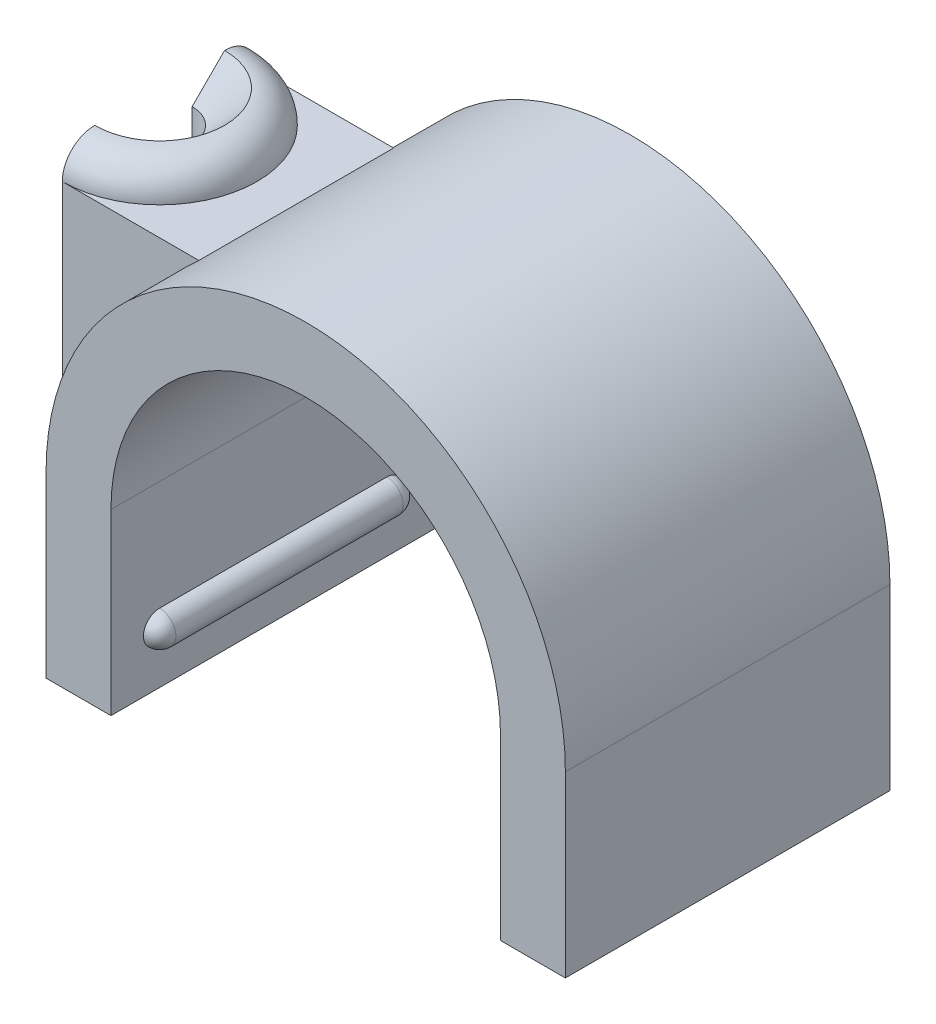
ISO-10303-21;
HEADER;
FILE_DESCRIPTION(('STEP AP214'),'2;1');
FILE_NAME('part.step','',(''),(''),'','','');
FILE_SCHEMA(('AUTOMOTIVE_DESIGN { 1 0 10303 214 1 1 1 1 }'));
ENDSEC;
DATA;
#1=APPLICATION_CONTEXT('core data for automotive mechanical design processes');
#2=APPLICATION_PROTOCOL_DEFINITION('international standard','automotive_design',2000,#1);
#3=PRODUCT_CONTEXT('',#1,'mechanical');
#4=PRODUCT('Part','Part','',(#3));
#5=PRODUCT_RELATED_PRODUCT_CATEGORY('part','',(#4));
#6=PRODUCT_DEFINITION_FORMATION('','',#4);
#7=PRODUCT_DEFINITION_CONTEXT('part definition',#1,'design');
#8=PRODUCT_DEFINITION('design','',#6,#7);
#9=PRODUCT_DEFINITION_SHAPE('','',#8);
#10=(LENGTH_UNIT() NAMED_UNIT(*) SI_UNIT(.MILLI.,.METRE.));
#11=(NAMED_UNIT(*) PLANE_ANGLE_UNIT() SI_UNIT($,.RADIAN.));
#12=(NAMED_UNIT(*) SI_UNIT($,.STERADIAN.) SOLID_ANGLE_UNIT());
#13=UNCERTAINTY_MEASURE_WITH_UNIT(LENGTH_MEASURE(1.E-05),#10,'distance_accuracy_value','');
#14=(GEOMETRIC_REPRESENTATION_CONTEXT(3) GLOBAL_UNCERTAINTY_ASSIGNED_CONTEXT((#13)) GLOBAL_UNIT_ASSIGNED_CONTEXT((#10,
#11,#12)) REPRESENTATION_CONTEXT('',''));
#15=CARTESIAN_POINT('',(0.,0.,0.));
#16=DIRECTION('',(0.,0.,1.));
#17=DIRECTION('',(1.,0.,0.));
#18=AXIS2_PLACEMENT_3D('',#15,#16,#17);
#19=CARTESIAN_POINT('',(0.,0.,-10.));
#20=DIRECTION('',(0.,-1.,0.));
#21=DIRECTION('',(0.,0.,-1.));
#22=AXIS2_PLACEMENT_3D('',#19,#20,#21);
#23=PLANE('',#22);
#24=DIRECTION('',(-1.,0.,0.));
#25=VECTOR('',#24,1.);
#26=CARTESIAN_POINT('',(16.001,0.,-2.));
#27=LINE('',#26,#25);
#28=CARTESIAN_POINT('',(0.,0.,-2.));
#29=VERTEX_POINT('',#28);
#30=CARTESIAN_POINT('',(-1.5,0.,-2.));
#31=VERTEX_POINT('',#30);
#32=EDGE_CURVE('E188',#29,#31,#27,.T.);
#33=ORIENTED_EDGE('',*,*,#32,.T.);
#34=DIRECTION('',(0.,0.,-1.));
#35=VECTOR('',#34,1.);
#36=CARTESIAN_POINT('',(-1.5,0.,1.26994984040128));
#37=LINE('',#36,#35);
#38=CARTESIAN_POINT('',(-1.5,1.1369377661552E-11,-4.));
#39=VERTEX_POINT('',#38);
#40=EDGE_CURVE('E184',#31,#39,#37,.T.);
#41=ORIENTED_EDGE('',*,*,#40,.T.);
#42=CARTESIAN_POINT('',(-1.5,1.1369377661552E-11,-5.));
#43=DIRECTION('',(0.,1.,0.));
#44=DIRECTION('',(0.,0.,1.));
#45=AXIS2_PLACEMENT_3D('',#42,#43,#44);
#46=CIRCLE('',#45,0.999999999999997);
#47=CARTESIAN_POINT('',(-1.5,1.1369377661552E-11,-6.));
#48=VERTEX_POINT('',#47);
#49=EDGE_CURVE('E370',#39,#48,#46,.T.);
#50=ORIENTED_EDGE('',*,*,#49,.T.);
#51=CARTESIAN_POINT('',(-1.5,0.,-8.));
#52=VERTEX_POINT('',#51);
#53=EDGE_CURVE('E56',#48,#52,#37,.T.);
#54=ORIENTED_EDGE('',*,*,#53,.T.);
#55=DIRECTION('',(-1.,0.,0.));
#56=VECTOR('',#55,1.);
#57=CARTESIAN_POINT('',(16.001,0.,-8.));
#58=LINE('',#57,#56);
#59=CARTESIAN_POINT('',(0.,0.,-8.));
#60=VERTEX_POINT('',#59);
#61=EDGE_CURVE('E220',#60,#52,#58,.T.);
#62=ORIENTED_EDGE('',*,*,#61,.F.);
#63=DIRECTION('',(0.,0.,1.));
#64=VECTOR('',#63,1.);
#65=CARTESIAN_POINT('',(0.,0.,-10.));
#66=LINE('',#65,#64);
#67=CARTESIAN_POINT('',(0.,0.,-10.));
#68=VERTEX_POINT('',#67);
#69=EDGE_CURVE('E273',#68,#60,#66,.T.);
#70=ORIENTED_EDGE('',*,*,#69,.F.);
#71=DIRECTION('',(1.,0.,0.));
#72=VECTOR('',#71,1.);
#73=CARTESIAN_POINT('',(0.,0.,-10.));
#74=LINE('',#73,#72);
#75=CARTESIAN_POINT('',(2.,0.,-10.));
#76=VERTEX_POINT('',#75);
#77=EDGE_CURVE('E248',#68,#76,#74,.T.);
#78=ORIENTED_EDGE('',*,*,#77,.T.);
#79=DIRECTION('',(0.,0.,1.));
#80=VECTOR('',#79,1.);
#81=CARTESIAN_POINT('',(2.,0.,-10.));
#82=LINE('',#81,#80);
#83=CARTESIAN_POINT('',(2.,0.,0.));
#84=VERTEX_POINT('',#83);
#85=EDGE_CURVE('E272',#76,#84,#82,.T.);
#86=ORIENTED_EDGE('',*,*,#85,.T.);
#87=DIRECTION('',(1.,0.,0.));
#88=VECTOR('',#87,1.);
#89=CARTESIAN_POINT('',(0.,0.,0.));
#90=LINE('',#89,#88);
#91=CARTESIAN_POINT('',(0.,0.,0.));
#92=VERTEX_POINT('',#91);
#93=EDGE_CURVE('E209',#92,#84,#90,.T.);
#94=ORIENTED_EDGE('',*,*,#93,.F.);
#95=EDGE_CURVE('E277',#29,#92,#66,.T.);
#96=ORIENTED_EDGE('',*,*,#95,.F.);
#97=EDGE_LOOP('',(#33,#41,#50,#54,#62,#70,#78,#86,#94,#96));
#98=FACE_BOUND('',#97,.T.);
#99=ADVANCED_FACE('F34',(#98),#23,.T.);
#100=CARTESIAN_POINT('',(-1.5,11.5,-5.));
#101=DIRECTION('',(0.,-1.,0.));
#102=DIRECTION('',(0.,0.,-1.));
#103=AXIS2_PLACEMENT_3D('',#100,#101,#102);
#104=TOROIDAL_SURFACE('',#103,2.,1.);
#105=CARTESIAN_POINT('',(-1.5,12.5,-5.));
#106=DIRECTION('',(0.,1.,0.));
#107=DIRECTION('',(0.,0.,1.));
#108=AXIS2_PLACEMENT_3D('',#105,#106,#107);
#109=CIRCLE('',#108,2.);
#110=CARTESIAN_POINT('',(-1.5,12.5,-3.));
#111=VERTEX_POINT('',#110);
#112=CARTESIAN_POINT('',(-1.5,12.5,-7.));
#113=VERTEX_POINT('',#112);
#114=EDGE_CURVE('E199',#111,#113,#109,.T.);
#115=ORIENTED_EDGE('',*,*,#114,.F.);
#116=CARTESIAN_POINT('',(-1.5,11.5,-3.));
#117=DIRECTION('',(-1.,0.,0.));
#118=DIRECTION('',(0.,0.,1.));
#119=AXIS2_PLACEMENT_3D('',#116,#117,#118);
#120=CIRCLE('',#119,1.);
#121=CARTESIAN_POINT('',(-1.5,11.5,-2.));
#122=VERTEX_POINT('',#121);
#123=EDGE_CURVE('E182',#122,#111,#120,.T.);
#124=ORIENTED_EDGE('',*,*,#123,.F.);
#125=CARTESIAN_POINT('',(-1.5,11.5,-5.));
#126=DIRECTION('',(0.,-1.,0.));
#127=DIRECTION('',(0.,0.,-1.));
#128=AXIS2_PLACEMENT_3D('',#125,#126,#127);
#129=CIRCLE('',#128,3.);
#130=CARTESIAN_POINT('',(-1.5,11.5,-8.));
#131=VERTEX_POINT('',#130);
#132=EDGE_CURVE('E197',#131,#122,#129,.T.);
#133=ORIENTED_EDGE('',*,*,#132,.F.);
#134=CARTESIAN_POINT('',(-1.5,11.5,-7.));
#135=DIRECTION('',(-1.,0.,0.));
#136=DIRECTION('',(0.,0.,1.));
#137=AXIS2_PLACEMENT_3D('',#134,#135,#136);
#138=CIRCLE('',#137,1.);
#139=EDGE_CURVE('E382',#113,#131,#138,.T.);
#140=ORIENTED_EDGE('',*,*,#139,.F.);
#141=EDGE_LOOP('',(#115,#124,#133,#140));
#142=FACE_BOUND('',#141,.T.);
#143=ADVANCED_FACE('F195',(#142),#104,.T.);
#144=CARTESIAN_POINT('',(-1.5,12.5,-5.));
#145=DIRECTION('',(0.,1.,0.));
#146=DIRECTION('',(0.,0.,1.));
#147=AXIS2_PLACEMENT_3D('',#144,#145,#146);
#148=CONICAL_SURFACE('',#147,2.,0.785398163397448);
#149=DIRECTION('',(0.,0.707106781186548,0.707106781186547));
#150=VECTOR('',#149,1.);
#151=CARTESIAN_POINT('',(-1.5,10.5,-5.));
#152=LINE('',#151,#150);
#153=CARTESIAN_POINT('',(-1.5,11.5,-4.));
#154=VERTEX_POINT('',#153);
#155=EDGE_CURVE('E48',#154,#111,#152,.T.);
#156=ORIENTED_EDGE('',*,*,#155,.T.);
#157=ORIENTED_EDGE('',*,*,#114,.T.);
#158=DIRECTION('',(0.,-0.707106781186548,0.707106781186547));
#159=VECTOR('',#158,1.);
#160=CARTESIAN_POINT('',(-1.5,10.5,-5.));
#161=LINE('',#160,#159);
#162=CARTESIAN_POINT('',(-1.5,11.5,-6.));
#163=VERTEX_POINT('',#162);
#164=EDGE_CURVE('E384',#113,#163,#161,.T.);
#165=ORIENTED_EDGE('',*,*,#164,.T.);
#166=CARTESIAN_POINT('',(-1.5,11.5,-5.));
#167=DIRECTION('',(0.,1.,0.));
#168=DIRECTION('',(0.,0.,1.));
#169=AXIS2_PLACEMENT_3D('',#166,#167,#168);
#170=CIRCLE('',#169,0.999999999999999);
#171=EDGE_CURVE('E367',#154,#163,#170,.T.);
#172=ORIENTED_EDGE('',*,*,#171,.F.);
#173=EDGE_LOOP('',(#156,#157,#165,#172));
#174=FACE_BOUND('',#173,.T.);
#175=ADVANCED_FACE('F349',(#174),#148,.F.);
#176=CARTESIAN_POINT('',(-1.5,12.5,-5.));
#177=DIRECTION('',(0.,1.,0.));
#178=DIRECTION('',(0.,0.,1.));
#179=AXIS2_PLACEMENT_3D('',#176,#177,#178);
#180=CYLINDRICAL_SURFACE('',#179,0.999999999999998);
#181=DIRECTION('',(0.,1.,0.));
#182=VECTOR('',#181,1.);
#183=CARTESIAN_POINT('',(-1.5,12.5,-4.));
#184=LINE('',#183,#182);
#185=EDGE_CURVE('E380',#39,#154,#184,.T.);
#186=ORIENTED_EDGE('',*,*,#185,.T.);
#187=ORIENTED_EDGE('',*,*,#171,.T.);
#188=DIRECTION('',(0.,1.,0.));
#189=VECTOR('',#188,1.);
#190=CARTESIAN_POINT('',(-1.5,12.5,-6.));
#191=LINE('',#190,#189);
#192=EDGE_CURVE('E387',#163,#48,#191,.F.);
#193=ORIENTED_EDGE('',*,*,#192,.T.);
#194=ORIENTED_EDGE('',*,*,#49,.F.);
#195=EDGE_LOOP('',(#186,#187,#193,#194));
#196=FACE_BOUND('',#195,.T.);
#197=ADVANCED_FACE('F444',(#196),#180,.F.);
#198=CARTESIAN_POINT('',(0.,0.,-10.));
#199=DIRECTION('',(-1.,0.,0.));
#200=DIRECTION('',(0.,0.,1.));
#201=AXIS2_PLACEMENT_3D('',#198,#199,#200);
#202=PLANE('',#201);
#203=ORIENTED_EDGE('',*,*,#69,.T.);
#204=DIRECTION('',(0.,-1.,0.));
#205=VECTOR('',#204,1.);
#206=CARTESIAN_POINT('',(0.,0.,-8.));
#207=LINE('',#206,#205);
#208=CARTESIAN_POINT('',(0.,5.5,-8.));
#209=VERTEX_POINT('',#208);
#210=EDGE_CURVE('E224',#209,#60,#207,.T.);
#211=ORIENTED_EDGE('',*,*,#210,.F.);
#212=DIRECTION('',(0.,0.,1.));
#213=VECTOR('',#212,1.);
#214=CARTESIAN_POINT('',(0.,5.5,-10.));
#215=LINE('',#214,#213);
#216=CARTESIAN_POINT('',(0.,5.5,-10.));
#217=VERTEX_POINT('',#216);
#218=EDGE_CURVE('E278',#217,#209,#215,.T.);
#219=ORIENTED_EDGE('',*,*,#218,.F.);
#220=DIRECTION('',(0.,-1.,0.));
#221=VECTOR('',#220,1.);
#222=CARTESIAN_POINT('',(0.,0.,-10.));
#223=LINE('',#222,#221);
#224=EDGE_CURVE('E269',#217,#68,#223,.T.);
#225=ORIENTED_EDGE('',*,*,#224,.T.);
#226=EDGE_LOOP('',(#203,#211,#219,#225));
#227=FACE_BOUND('',#226,.T.);
#228=ADVANCED_FACE('F394',(#227),#202,.T.);
#229=CARTESIAN_POINT('',(0.,5.5,-2.));
#230=VERTEX_POINT('',#229);
#231=CARTESIAN_POINT('',(0.,5.5,0.));
#232=VERTEX_POINT('',#231);
#233=EDGE_CURVE('E281',#230,#232,#215,.T.);
#234=ORIENTED_EDGE('',*,*,#233,.F.);
#235=DIRECTION('',(0.,1.,0.));
#236=VECTOR('',#235,1.);
#237=CARTESIAN_POINT('',(0.,0.,-2.));
#238=LINE('',#237,#236);
#239=EDGE_CURVE('E215',#29,#230,#238,.T.);
#240=ORIENTED_EDGE('',*,*,#239,.F.);
#241=ORIENTED_EDGE('',*,*,#95,.T.);
#242=DIRECTION('',(0.,-1.,0.));
#243=VECTOR('',#242,1.);
#244=CARTESIAN_POINT('',(0.,0.,0.));
#245=LINE('',#244,#243);
#246=EDGE_CURVE('E245',#232,#92,#245,.T.);
#247=ORIENTED_EDGE('',*,*,#246,.F.);
#248=EDGE_LOOP('',(#234,#240,#241,#247));
#249=FACE_BOUND('',#248,.T.);
#250=ADVANCED_FACE('F415',(#249),#202,.T.);
#251=CARTESIAN_POINT('',(8.,5.5,-10.));
#252=DIRECTION('',(0.,0.,1.));
#253=DIRECTION('',(1.,0.,0.));
#254=AXIS2_PLACEMENT_3D('',#251,#252,#253);
#255=CYLINDRICAL_SURFACE('',#254,8.);
#256=ORIENTED_EDGE('',*,*,#218,.T.);
#257=CARTESIAN_POINT('',(8.,5.5,-8.));
#258=DIRECTION('',(0.,0.,1.));
#259=DIRECTION('',(1.,0.,0.));
#260=AXIS2_PLACEMENT_3D('',#257,#258,#259);
#261=CIRCLE('',#260,8.);
#262=CARTESIAN_POINT('',(2.70849737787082,11.5,-8.));
#263=VERTEX_POINT('',#262);
#264=EDGE_CURVE('E360',#263,#209,#261,.T.);
#265=ORIENTED_EDGE('',*,*,#264,.F.);
#266=DIRECTION('',(0.,0.,1.));
#267=VECTOR('',#266,1.);
#268=CARTESIAN_POINT('',(2.70849737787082,11.5,-10.));
#269=LINE('',#268,#267);
#270=CARTESIAN_POINT('',(2.70849737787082,11.5,-2.));
#271=VERTEX_POINT('',#270);
#272=EDGE_CURVE('E356',#271,#263,#269,.F.);
#273=ORIENTED_EDGE('',*,*,#272,.F.);
#274=CARTESIAN_POINT('',(8.,5.5,-2.));
#275=DIRECTION('',(0.,0.,-1.));
#276=DIRECTION('',(0.,1.,0.));
#277=AXIS2_PLACEMENT_3D('',#274,#275,#276);
#278=CIRCLE('',#277,8.);
#279=EDGE_CURVE('E213',#230,#271,#278,.T.);
#280=ORIENTED_EDGE('',*,*,#279,.F.);
#281=ORIENTED_EDGE('',*,*,#233,.T.);
#282=CARTESIAN_POINT('',(8.,5.5,0.));
#283=DIRECTION('',(0.,0.,1.));
#284=DIRECTION('',(-1.,0.,0.));
#285=AXIS2_PLACEMENT_3D('',#282,#283,#284);
#286=CIRCLE('',#285,8.);
#287=CARTESIAN_POINT('',(16.,5.5,0.));
#288=VERTEX_POINT('',#287);
#289=EDGE_CURVE('E242',#288,#232,#286,.T.);
#290=ORIENTED_EDGE('',*,*,#289,.F.);
#291=DIRECTION('',(0.,0.,1.));
#292=VECTOR('',#291,1.);
#293=CARTESIAN_POINT('',(16.,5.5,-10.));
#294=LINE('',#293,#292);
#295=CARTESIAN_POINT('',(16.,5.5,-10.));
#296=VERTEX_POINT('',#295);
#297=EDGE_CURVE('E282',#296,#288,#294,.T.);
#298=ORIENTED_EDGE('',*,*,#297,.F.);
#299=CARTESIAN_POINT('',(8.,5.5,-10.));
#300=DIRECTION('',(0.,0.,1.));
#301=DIRECTION('',(-1.,0.,0.));
#302=AXIS2_PLACEMENT_3D('',#299,#300,#301);
#303=CIRCLE('',#302,8.);
#304=EDGE_CURVE('E266',#296,#217,#303,.T.);
#305=ORIENTED_EDGE('',*,*,#304,.T.);
#306=EDGE_LOOP('',(#256,#265,#273,#280,#281,#290,#298,#305));
#307=FACE_BOUND('',#306,.T.);
#308=ADVANCED_FACE('F396',(#307),#255,.T.);
#309=CARTESIAN_POINT('',(16.,0.,-10.));
#310=DIRECTION('',(1.,0.,0.));
#311=DIRECTION('',(0.,0.,-1.));
#312=AXIS2_PLACEMENT_3D('',#309,#310,#311);
#313=PLANE('',#312);
#314=DIRECTION('',(0.,1.,0.));
#315=VECTOR('',#314,1.);
#316=CARTESIAN_POINT('',(16.,0.,0.));
#317=LINE('',#316,#315);
#318=CARTESIAN_POINT('',(16.,0.,0.));
#319=VERTEX_POINT('',#318);
#320=EDGE_CURVE('E239',#319,#288,#317,.T.);
#321=ORIENTED_EDGE('',*,*,#320,.F.);
#322=DIRECTION('',(0.,0.,1.));
#323=VECTOR('',#322,1.);
#324=CARTESIAN_POINT('',(16.,0.,-10.));
#325=LINE('',#324,#323);
#326=CARTESIAN_POINT('',(16.,0.,-10.));
#327=VERTEX_POINT('',#326);
#328=EDGE_CURVE('E284',#327,#319,#325,.T.);
#329=ORIENTED_EDGE('',*,*,#328,.F.);
#330=DIRECTION('',(0.,1.,0.));
#331=VECTOR('',#330,1.);
#332=CARTESIAN_POINT('',(16.,0.,-10.));
#333=LINE('',#332,#331);
#334=EDGE_CURVE('E263',#327,#296,#333,.T.);
#335=ORIENTED_EDGE('',*,*,#334,.T.);
#336=ORIENTED_EDGE('',*,*,#297,.T.);
#337=EDGE_LOOP('',(#321,#329,#335,#336));
#338=FACE_BOUND('',#337,.T.);
#339=ADVANCED_FACE('F419',(#338),#313,.T.);
#340=CARTESIAN_POINT('',(14.,0.,-10.));
#341=DIRECTION('',(0.,-1.,0.));
#342=DIRECTION('',(0.,0.,-1.));
#343=AXIS2_PLACEMENT_3D('',#340,#341,#342);
#344=PLANE('',#343);
#345=DIRECTION('',(1.,0.,0.));
#346=VECTOR('',#345,1.);
#347=CARTESIAN_POINT('',(14.,0.,0.));
#348=LINE('',#347,#346);
#349=CARTESIAN_POINT('',(14.,0.,0.));
#350=VERTEX_POINT('',#349);
#351=EDGE_CURVE('E236',#350,#319,#348,.T.);
#352=ORIENTED_EDGE('',*,*,#351,.F.);
#353=DIRECTION('',(0.,0.,1.));
#354=VECTOR('',#353,1.);
#355=CARTESIAN_POINT('',(14.,0.,-10.));
#356=LINE('',#355,#354);
#357=CARTESIAN_POINT('',(14.,0.,-10.));
#358=VERTEX_POINT('',#357);
#359=EDGE_CURVE('E286',#358,#350,#356,.T.);
#360=ORIENTED_EDGE('',*,*,#359,.F.);
#361=DIRECTION('',(1.,0.,0.));
#362=VECTOR('',#361,1.);
#363=CARTESIAN_POINT('',(14.,0.,-10.));
#364=LINE('',#363,#362);
#365=EDGE_CURVE('E260',#358,#327,#364,.T.);
#366=ORIENTED_EDGE('',*,*,#365,.T.);
#367=ORIENTED_EDGE('',*,*,#328,.T.);
#368=EDGE_LOOP('',(#352,#360,#366,#367));
#369=FACE_BOUND('',#368,.T.);
#370=ADVANCED_FACE('F423',(#369),#344,.T.);
#371=CARTESIAN_POINT('',(14.,0.,-10.));
#372=DIRECTION('',(-1.,0.,0.));
#373=DIRECTION('',(0.,0.,1.));
#374=AXIS2_PLACEMENT_3D('',#371,#372,#373);
#375=PLANE('',#374);
#376=CARTESIAN_POINT('',(14.,1.61906828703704,-1.5));
#377=DIRECTION('',(-1.,0.,0.));
#378=DIRECTION('',(0.,0.,1.));
#379=AXIS2_PLACEMENT_3D('',#376,#377,#378);
#380=CIRCLE('',#379,0.5);
#381=CARTESIAN_POINT('',(14.,2.11906828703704,-1.5));
#382=VERTEX_POINT('',#381);
#383=CARTESIAN_POINT('',(14.,1.61906828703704,-1.));
#384=VERTEX_POINT('',#383);
#385=EDGE_CURVE('E312',#382,#384,#380,.F.);
#386=ORIENTED_EDGE('',*,*,#385,.T.);
#387=CARTESIAN_POINT('',(14.,1.61906828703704,-1.5));
#388=DIRECTION('',(-1.,0.,0.));
#389=DIRECTION('',(0.,0.,1.));
#390=AXIS2_PLACEMENT_3D('',#387,#388,#389);
#391=CIRCLE('',#390,0.5);
#392=CARTESIAN_POINT('',(14.,1.11906828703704,-1.5));
#393=VERTEX_POINT('',#392);
#394=EDGE_CURVE('E314',#384,#393,#391,.F.);
#395=ORIENTED_EDGE('',*,*,#394,.T.);
#396=DIRECTION('',(0.,0.,-1.));
#397=VECTOR('',#396,1.);
#398=CARTESIAN_POINT('',(14.,1.11906828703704,-1.));
#399=LINE('',#398,#397);
#400=CARTESIAN_POINT('',(14.,1.11906828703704,-8.5));
#401=VERTEX_POINT('',#400);
#402=EDGE_CURVE('E328',#393,#401,#399,.T.);
#403=ORIENTED_EDGE('',*,*,#402,.T.);
#404=CARTESIAN_POINT('',(14.,1.61906828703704,-8.5));
#405=DIRECTION('',(-1.,0.,0.));
#406=DIRECTION('',(0.,0.,1.));
#407=AXIS2_PLACEMENT_3D('',#404,#405,#406);
#408=CIRCLE('',#407,0.5);
#409=CARTESIAN_POINT('',(14.,1.61906828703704,-9.));
#410=VERTEX_POINT('',#409);
#411=EDGE_CURVE('E13',#401,#410,#408,.F.);
#412=ORIENTED_EDGE('',*,*,#411,.T.);
#413=CARTESIAN_POINT('',(14.,1.61906828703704,-8.5));
#414=DIRECTION('',(-1.,0.,0.));
#415=DIRECTION('',(0.,0.,1.));
#416=AXIS2_PLACEMENT_3D('',#413,#414,#415);
#417=CIRCLE('',#416,0.5);
#418=CARTESIAN_POINT('',(14.,2.11906828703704,-8.5));
#419=VERTEX_POINT('',#418);
#420=EDGE_CURVE('E41',#410,#419,#417,.F.);
#421=ORIENTED_EDGE('',*,*,#420,.T.);
#422=DIRECTION('',(0.,0.,-1.));
#423=VECTOR('',#422,1.);
#424=CARTESIAN_POINT('',(14.,2.11906828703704,-1.));
#425=LINE('',#424,#423);
#426=EDGE_CURVE('E200',#382,#419,#425,.T.);
#427=ORIENTED_EDGE('',*,*,#426,.F.);
#428=EDGE_LOOP('',(#386,#395,#403,#412,#421,#427));
#429=FACE_BOUND('',#428,.T.);
#430=DIRECTION('',(0.,-1.,0.));
#431=VECTOR('',#430,1.);
#432=CARTESIAN_POINT('',(14.,0.,0.));
#433=LINE('',#432,#431);
#434=CARTESIAN_POINT('',(14.,5.5,0.));
#435=VERTEX_POINT('',#434);
#436=EDGE_CURVE('E233',#435,#350,#433,.T.);
#437=ORIENTED_EDGE('',*,*,#436,.F.);
#438=DIRECTION('',(0.,0.,1.));
#439=VECTOR('',#438,1.);
#440=CARTESIAN_POINT('',(14.,5.5,-10.));
#441=LINE('',#440,#439);
#442=CARTESIAN_POINT('',(14.,5.5,-10.));
#443=VERTEX_POINT('',#442);
#444=EDGE_CURVE('E288',#443,#435,#441,.T.);
#445=ORIENTED_EDGE('',*,*,#444,.F.);
#446=DIRECTION('',(0.,-1.,0.));
#447=VECTOR('',#446,1.);
#448=CARTESIAN_POINT('',(14.,0.,-10.));
#449=LINE('',#448,#447);
#450=EDGE_CURVE('E257',#443,#358,#449,.T.);
#451=ORIENTED_EDGE('',*,*,#450,.T.);
#452=ORIENTED_EDGE('',*,*,#359,.T.);
#453=EDGE_LOOP('',(#437,#445,#451,#452));
#454=FACE_BOUND('',#453,.T.);
#455=ADVANCED_FACE('F319',(#429,#454),#375,.T.);
#456=CARTESIAN_POINT('',(8.,5.5,-10.));
#457=DIRECTION('',(0.,0.,1.));
#458=DIRECTION('',(1.,0.,0.));
#459=AXIS2_PLACEMENT_3D('',#456,#457,#458);
#460=CYLINDRICAL_SURFACE('',#459,6.);
#461=CARTESIAN_POINT('',(8.,5.5,0.));
#462=DIRECTION('',(0.,0.,-1.));
#463=DIRECTION('',(-1.,0.,0.));
#464=AXIS2_PLACEMENT_3D('',#461,#462,#463);
#465=CIRCLE('',#464,6.);
#466=CARTESIAN_POINT('',(2.,5.5,0.));
#467=VERTEX_POINT('',#466);
#468=EDGE_CURVE('E230',#467,#435,#465,.T.);
#469=ORIENTED_EDGE('',*,*,#468,.F.);
#470=DIRECTION('',(0.,0.,1.));
#471=VECTOR('',#470,1.);
#472=CARTESIAN_POINT('',(2.,5.5,-10.));
#473=LINE('',#472,#471);
#474=CARTESIAN_POINT('',(2.,5.5,-10.));
#475=VERTEX_POINT('',#474);
#476=EDGE_CURVE('E290',#475,#467,#473,.T.);
#477=ORIENTED_EDGE('',*,*,#476,.F.);
#478=CARTESIAN_POINT('',(8.,5.5,-10.));
#479=DIRECTION('',(0.,0.,-1.));
#480=DIRECTION('',(-1.,0.,0.));
#481=AXIS2_PLACEMENT_3D('',#478,#479,#480);
#482=CIRCLE('',#481,6.);
#483=EDGE_CURVE('E254',#475,#443,#482,.T.);
#484=ORIENTED_EDGE('',*,*,#483,.T.);
#485=ORIENTED_EDGE('',*,*,#444,.T.);
#486=EDGE_LOOP('',(#469,#477,#484,#485));
#487=FACE_BOUND('',#486,.T.);
#488=ADVANCED_FACE('F426',(#487),#460,.F.);
#489=CARTESIAN_POINT('',(2.,0.,-10.));
#490=DIRECTION('',(1.,0.,0.));
#491=DIRECTION('',(0.,0.,-1.));
#492=AXIS2_PLACEMENT_3D('',#489,#490,#491);
#493=PLANE('',#492);
#494=DIRECTION('',(0.,0.,-1.));
#495=VECTOR('',#494,1.);
#496=CARTESIAN_POINT('',(2.,1.11906828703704,-1.));
#497=LINE('',#496,#495);
#498=CARTESIAN_POINT('',(2.,1.11906828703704,-1.5));
#499=VERTEX_POINT('',#498);
#500=CARTESIAN_POINT('',(2.,1.11906828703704,-8.5));
#501=VERTEX_POINT('',#500);
#502=EDGE_CURVE('E375',#499,#501,#497,.T.);
#503=ORIENTED_EDGE('',*,*,#502,.F.);
#504=CARTESIAN_POINT('',(2.,1.61906828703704,-1.5));
#505=DIRECTION('',(1.,0.,0.));
#506=DIRECTION('',(0.,0.,-1.));
#507=AXIS2_PLACEMENT_3D('',#504,#505,#506);
#508=CIRCLE('',#507,0.5);
#509=CARTESIAN_POINT('',(2.,1.61906828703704,-1.));
#510=VERTEX_POINT('',#509);
#511=EDGE_CURVE('E300',#499,#510,#508,.F.);
#512=ORIENTED_EDGE('',*,*,#511,.T.);
#513=CARTESIAN_POINT('',(2.,1.61906828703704,-1.5));
#514=DIRECTION('',(1.,0.,0.));
#515=DIRECTION('',(0.,0.,-1.));
#516=AXIS2_PLACEMENT_3D('',#513,#514,#515);
#517=CIRCLE('',#516,0.5);
#518=CARTESIAN_POINT('',(2.,2.11906828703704,-1.5));
#519=VERTEX_POINT('',#518);
#520=EDGE_CURVE('E298',#510,#519,#517,.F.);
#521=ORIENTED_EDGE('',*,*,#520,.T.);
#522=DIRECTION('',(0.,0.,-1.));
#523=VECTOR('',#522,1.);
#524=CARTESIAN_POINT('',(2.,2.11906828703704,-1.));
#525=LINE('',#524,#523);
#526=CARTESIAN_POINT('',(2.,2.11906828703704,-8.5));
#527=VERTEX_POINT('',#526);
#528=EDGE_CURVE('E372',#519,#527,#525,.T.);
#529=ORIENTED_EDGE('',*,*,#528,.T.);
#530=CARTESIAN_POINT('',(2.,1.61906828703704,-8.5));
#531=DIRECTION('',(1.,0.,0.));
#532=DIRECTION('',(0.,0.,-1.));
#533=AXIS2_PLACEMENT_3D('',#530,#531,#532);
#534=CIRCLE('',#533,0.5);
#535=CARTESIAN_POINT('',(2.,1.61906828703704,-9.));
#536=VERTEX_POINT('',#535);
#537=EDGE_CURVE('E302',#527,#536,#534,.F.);
#538=ORIENTED_EDGE('',*,*,#537,.T.);
#539=CARTESIAN_POINT('',(2.,1.61906828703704,-8.5));
#540=DIRECTION('',(1.,0.,0.));
#541=DIRECTION('',(0.,0.,-1.));
#542=AXIS2_PLACEMENT_3D('',#539,#540,#541);
#543=CIRCLE('',#542,0.5);
#544=EDGE_CURVE('E304',#536,#501,#543,.F.);
#545=ORIENTED_EDGE('',*,*,#544,.T.);
#546=EDGE_LOOP('',(#503,#512,#521,#529,#538,#545));
#547=FACE_BOUND('',#546,.T.);
#548=DIRECTION('',(0.,1.,0.));
#549=VECTOR('',#548,1.);
#550=CARTESIAN_POINT('',(2.,0.,0.));
#551=LINE('',#550,#549);
#552=EDGE_CURVE('E227',#84,#467,#551,.T.);
#553=ORIENTED_EDGE('',*,*,#552,.F.);
#554=ORIENTED_EDGE('',*,*,#85,.F.);
#555=DIRECTION('',(0.,1.,0.));
#556=VECTOR('',#555,1.);
#557=CARTESIAN_POINT('',(2.,0.,-10.));
#558=LINE('',#557,#556);
#559=EDGE_CURVE('E251',#76,#475,#558,.T.);
#560=ORIENTED_EDGE('',*,*,#559,.T.);
#561=ORIENTED_EDGE('',*,*,#476,.T.);
#562=EDGE_LOOP('',(#553,#554,#560,#561));
#563=FACE_BOUND('',#562,.T.);
#564=ADVANCED_FACE('F408',(#547,#563),#493,.T.);
#565=CARTESIAN_POINT('',(8.,5.5,-10.));
#566=DIRECTION('',(0.,0.,-1.));
#567=DIRECTION('',(-1.,0.,0.));
#568=AXIS2_PLACEMENT_3D('',#565,#566,#567);
#569=PLANE('',#568);
#570=ORIENTED_EDGE('',*,*,#77,.F.);
#571=ORIENTED_EDGE('',*,*,#224,.F.);
#572=ORIENTED_EDGE('',*,*,#304,.F.);
#573=ORIENTED_EDGE('',*,*,#334,.F.);
#574=ORIENTED_EDGE('',*,*,#365,.F.);
#575=ORIENTED_EDGE('',*,*,#450,.F.);
#576=ORIENTED_EDGE('',*,*,#483,.F.);
#577=ORIENTED_EDGE('',*,*,#559,.F.);
#578=EDGE_LOOP('',(#570,#571,#572,#573,#574,#575,#576,#577));
#579=FACE_BOUND('',#578,.T.);
#580=ADVANCED_FACE('F403',(#579),#569,.T.);
#581=CARTESIAN_POINT('',(8.,5.5,0.));
#582=DIRECTION('',(0.,0.,-1.));
#583=DIRECTION('',(-1.,0.,0.));
#584=AXIS2_PLACEMENT_3D('',#581,#582,#583);
#585=PLANE('',#584);
#586=ORIENTED_EDGE('',*,*,#93,.T.);
#587=ORIENTED_EDGE('',*,*,#552,.T.);
#588=ORIENTED_EDGE('',*,*,#468,.T.);
#589=ORIENTED_EDGE('',*,*,#436,.T.);
#590=ORIENTED_EDGE('',*,*,#351,.T.);
#591=ORIENTED_EDGE('',*,*,#320,.T.);
#592=ORIENTED_EDGE('',*,*,#289,.T.);
#593=ORIENTED_EDGE('',*,*,#246,.T.);
#594=EDGE_LOOP('',(#586,#587,#588,#589,#590,#591,#592,#593));
#595=FACE_BOUND('',#594,.T.);
#596=ADVANCED_FACE('F411',(#595),#585,.F.);
#597=CARTESIAN_POINT('',(16.001,0.,-8.));
#598=DIRECTION('',(0.,0.,1.));
#599=DIRECTION('',(1.,0.,0.));
#600=AXIS2_PLACEMENT_3D('',#597,#598,#599);
#601=PLANE('',#600);
#602=ORIENTED_EDGE('',*,*,#264,.T.);
#603=ORIENTED_EDGE('',*,*,#210,.T.);
#604=ORIENTED_EDGE('',*,*,#61,.T.);
#605=DIRECTION('',(0.,1.,0.));
#606=VECTOR('',#605,1.);
#607=CARTESIAN_POINT('',(-1.5,0.,-8.));
#608=LINE('',#607,#606);
#609=EDGE_CURVE('E223',#52,#131,#608,.T.);
#610=ORIENTED_EDGE('',*,*,#609,.T.);
#611=DIRECTION('',(-1.,0.,0.));
#612=VECTOR('',#611,1.);
#613=CARTESIAN_POINT('',(16.001,11.5,-8.));
#614=LINE('',#613,#612);
#615=EDGE_CURVE('E208',#263,#131,#614,.T.);
#616=ORIENTED_EDGE('',*,*,#615,.F.);
#617=EDGE_LOOP('',(#602,#603,#604,#610,#616));
#618=FACE_BOUND('',#617,.T.);
#619=ADVANCED_FACE('F390',(#618),#601,.F.);
#620=CARTESIAN_POINT('',(16.001,0.,-2.));
#621=DIRECTION('',(0.,0.,-1.));
#622=DIRECTION('',(0.,1.,0.));
#623=AXIS2_PLACEMENT_3D('',#620,#621,#622);
#624=PLANE('',#623);
#625=ORIENTED_EDGE('',*,*,#32,.F.);
#626=ORIENTED_EDGE('',*,*,#239,.T.);
#627=ORIENTED_EDGE('',*,*,#279,.T.);
#628=DIRECTION('',(-1.,0.,0.));
#629=VECTOR('',#628,1.);
#630=CARTESIAN_POINT('',(16.001,11.5,-2.));
#631=LINE('',#630,#629);
#632=EDGE_CURVE('E189',#271,#122,#631,.T.);
#633=ORIENTED_EDGE('',*,*,#632,.T.);
#634=DIRECTION('',(0.,-1.,0.));
#635=VECTOR('',#634,1.);
#636=CARTESIAN_POINT('',(-1.5,0.,-2.));
#637=LINE('',#636,#635);
#638=EDGE_CURVE('E179',#122,#31,#637,.T.);
#639=ORIENTED_EDGE('',*,*,#638,.T.);
#640=EDGE_LOOP('',(#625,#626,#627,#633,#639));
#641=FACE_BOUND('',#640,.T.);
#642=ADVANCED_FACE('F211',(#641),#624,.F.);
#643=CARTESIAN_POINT('',(16.001,11.5,-8.));
#644=DIRECTION('',(0.,-1.,0.));
#645=DIRECTION('',(0.,0.,-1.));
#646=AXIS2_PLACEMENT_3D('',#643,#644,#645);
#647=PLANE('',#646);
#648=ORIENTED_EDGE('',*,*,#632,.F.);
#649=ORIENTED_EDGE('',*,*,#272,.T.);
#650=ORIENTED_EDGE('',*,*,#615,.T.);
#651=ORIENTED_EDGE('',*,*,#132,.T.);
#652=EDGE_LOOP('',(#648,#649,#650,#651));
#653=FACE_BOUND('',#652,.T.);
#654=ADVANCED_FACE('F205',(#653),#647,.F.);
#655=CARTESIAN_POINT('',(2.,1.61906828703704,-1.));
#656=DIRECTION('',(0.,0.,-1.));
#657=DIRECTION('',(-1.,0.,0.));
#658=AXIS2_PLACEMENT_3D('',#655,#656,#657);
#659=CYLINDRICAL_SURFACE('',#658,0.5);
#660=ORIENTED_EDGE('',*,*,#528,.F.);
#661=CARTESIAN_POINT('',(2.,1.61906828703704,-1.5));
#662=DIRECTION('',(0.,0.,-1.));
#663=DIRECTION('',(-1.,0.,0.));
#664=AXIS2_PLACEMENT_3D('',#661,#662,#663);
#665=CIRCLE('',#664,0.5);
#666=EDGE_CURVE('E295',#519,#499,#665,.T.);
#667=ORIENTED_EDGE('',*,*,#666,.T.);
#668=ORIENTED_EDGE('',*,*,#502,.T.);
#669=CARTESIAN_POINT('',(2.,1.61906828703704,-8.5));
#670=DIRECTION('',(0.,0.,-1.));
#671=DIRECTION('',(-1.,0.,0.));
#672=AXIS2_PLACEMENT_3D('',#669,#670,#671);
#673=CIRCLE('',#672,0.5);
#674=EDGE_CURVE('E276',#501,#527,#673,.F.);
#675=ORIENTED_EDGE('',*,*,#674,.T.);
#676=EDGE_LOOP('',(#660,#667,#668,#675));
#677=FACE_BOUND('',#676,.T.);
#678=ADVANCED_FACE('F454',(#677),#659,.T.);
#679=CARTESIAN_POINT('',(2.,1.61906828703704,-1.5));
#680=DIRECTION('',(0.,0.,1.));
#681=DIRECTION('',(1.,0.,0.));
#682=AXIS2_PLACEMENT_3D('',#679,#680,#681);
#683=SPHERICAL_SURFACE('',#682,0.5);
#684=ORIENTED_EDGE('',*,*,#511,.F.);
#685=ORIENTED_EDGE('',*,*,#666,.F.);
#686=ORIENTED_EDGE('',*,*,#520,.F.);
#687=EDGE_LOOP('',(#684,#685,#686));
#688=FACE_BOUND('',#687,.T.);
#689=ADVANCED_FACE('F463',(#688),#683,.T.);
#690=CARTESIAN_POINT('',(2.,1.61906828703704,-8.5));
#691=DIRECTION('',(0.,0.,1.));
#692=DIRECTION('',(1.,0.,0.));
#693=AXIS2_PLACEMENT_3D('',#690,#691,#692);
#694=SPHERICAL_SURFACE('',#693,0.5);
#695=ORIENTED_EDGE('',*,*,#674,.F.);
#696=ORIENTED_EDGE('',*,*,#544,.F.);
#697=ORIENTED_EDGE('',*,*,#537,.F.);
#698=EDGE_LOOP('',(#695,#696,#697));
#699=FACE_BOUND('',#698,.T.);
#700=ADVANCED_FACE('F467',(#699),#694,.T.);
#701=CARTESIAN_POINT('',(14.,1.61906828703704,-1.));
#702=DIRECTION('',(0.,0.,-1.));
#703=DIRECTION('',(-1.,0.,0.));
#704=AXIS2_PLACEMENT_3D('',#701,#702,#703);
#705=CYLINDRICAL_SURFACE('',#704,0.5);
#706=ORIENTED_EDGE('',*,*,#402,.F.);
#707=CARTESIAN_POINT('',(14.,1.61906828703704,-1.5));
#708=DIRECTION('',(0.,0.,-1.));
#709=DIRECTION('',(-1.,0.,0.));
#710=AXIS2_PLACEMENT_3D('',#707,#708,#709);
#711=CIRCLE('',#710,0.5);
#712=EDGE_CURVE('E309',#393,#382,#711,.T.);
#713=ORIENTED_EDGE('',*,*,#712,.T.);
#714=ORIENTED_EDGE('',*,*,#426,.T.);
#715=CARTESIAN_POINT('',(14.,1.61906828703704,-8.5));
#716=DIRECTION('',(0.,0.,-1.));
#717=DIRECTION('',(-1.,0.,0.));
#718=AXIS2_PLACEMENT_3D('',#715,#716,#717);
#719=CIRCLE('',#718,0.5);
#720=EDGE_CURVE('E306',#419,#401,#719,.F.);
#721=ORIENTED_EDGE('',*,*,#720,.T.);
#722=EDGE_LOOP('',(#706,#713,#714,#721));
#723=FACE_BOUND('',#722,.T.);
#724=ADVANCED_FACE('F326',(#723),#705,.T.);
#725=CARTESIAN_POINT('',(14.,1.61906828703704,-1.5));
#726=DIRECTION('',(0.,0.,1.));
#727=DIRECTION('',(1.,0.,0.));
#728=AXIS2_PLACEMENT_3D('',#725,#726,#727);
#729=SPHERICAL_SURFACE('',#728,0.5);
#730=ORIENTED_EDGE('',*,*,#712,.F.);
#731=ORIENTED_EDGE('',*,*,#394,.F.);
#732=ORIENTED_EDGE('',*,*,#385,.F.);
#733=EDGE_LOOP('',(#730,#731,#732));
#734=FACE_BOUND('',#733,.T.);
#735=ADVANCED_FACE('F333',(#734),#729,.T.);
#736=CARTESIAN_POINT('',(14.,1.61906828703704,-8.5));
#737=DIRECTION('',(0.,0.,1.));
#738=DIRECTION('',(1.,0.,0.));
#739=AXIS2_PLACEMENT_3D('',#736,#737,#738);
#740=SPHERICAL_SURFACE('',#739,0.5);
#741=ORIENTED_EDGE('',*,*,#411,.F.);
#742=ORIENTED_EDGE('',*,*,#720,.F.);
#743=ORIENTED_EDGE('',*,*,#420,.F.);
#744=EDGE_LOOP('',(#741,#742,#743));
#745=FACE_BOUND('',#744,.T.);
#746=ADVANCED_FACE('F330',(#745),#740,.T.);
#747=CARTESIAN_POINT('',(-1.5,14.2990196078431,1.26994984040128));
#748=DIRECTION('',(-1.,0.,0.));
#749=DIRECTION('',(0.,0.,1.));
#750=AXIS2_PLACEMENT_3D('',#747,#748,#749);
#751=PLANE('',#750);
#752=ORIENTED_EDGE('',*,*,#53,.F.);
#753=ORIENTED_EDGE('',*,*,#192,.F.);
#754=ORIENTED_EDGE('',*,*,#164,.F.);
#755=ORIENTED_EDGE('',*,*,#139,.T.);
#756=ORIENTED_EDGE('',*,*,#609,.F.);
#757=EDGE_LOOP('',(#752,#753,#754,#755,#756));
#758=FACE_BOUND('',#757,.T.);
#759=ADVANCED_FACE('F332',(#758),#751,.T.);
#760=ORIENTED_EDGE('',*,*,#123,.T.);
#761=ORIENTED_EDGE('',*,*,#155,.F.);
#762=ORIENTED_EDGE('',*,*,#185,.F.);
#763=ORIENTED_EDGE('',*,*,#40,.F.);
#764=ORIENTED_EDGE('',*,*,#638,.F.);
#765=EDGE_LOOP('',(#760,#761,#762,#763,#764));
#766=FACE_BOUND('',#765,.T.);
#767=ADVANCED_FACE('F181',(#766),#751,.T.);
#768=CLOSED_SHELL('',(#99,#143,#175,#197,#228,#250,#308,#339,#370,#455,#488,#564,#580,#596,#619,
#642,#654,#678,#689,#700,#724,#735,#746,#759,#767));
#769=MANIFOLD_SOLID_BREP('B2',#768);
#770=ADVANCED_BREP_SHAPE_REPRESENTATION('',(#18,#769),#14);
#771=SHAPE_DEFINITION_REPRESENTATION(#9,#770);
ENDSEC;
END-ISO-10303-21;
